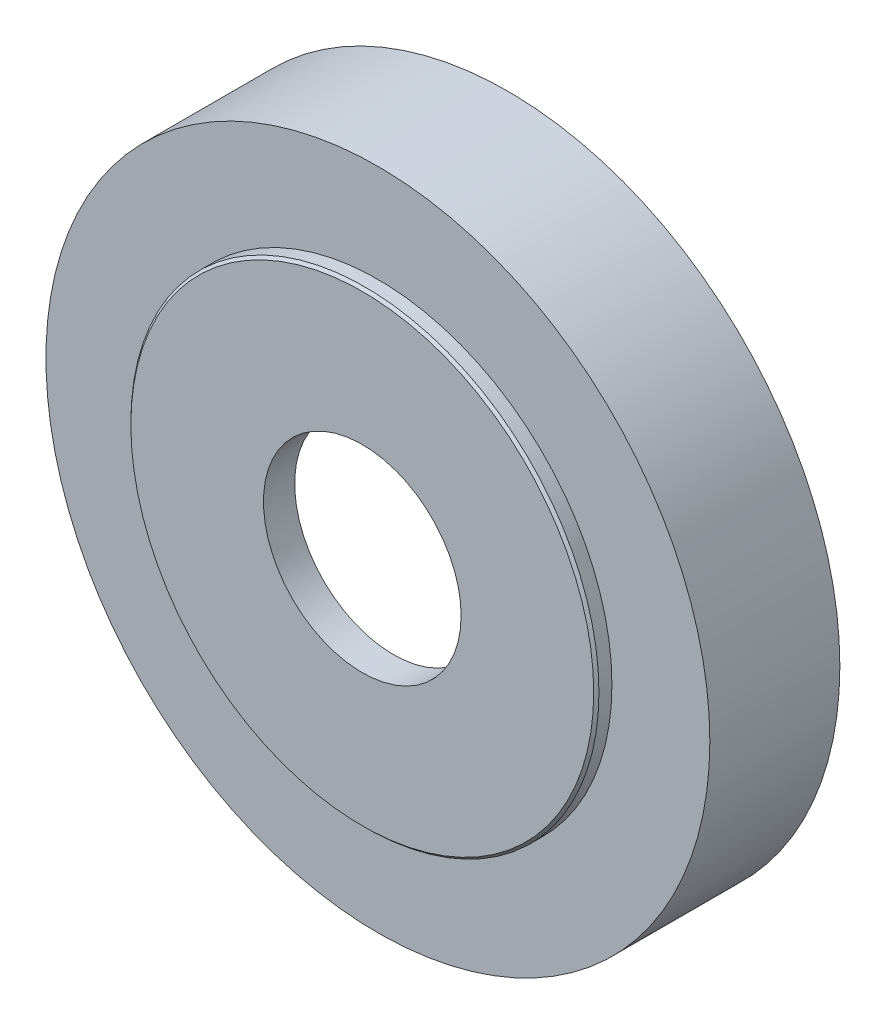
ISO-10303-21;
HEADER;
FILE_DESCRIPTION(('STEP AP214'),'2;1');
FILE_NAME('part.step','',(''),(''),'','','');
FILE_SCHEMA(('AUTOMOTIVE_DESIGN { 1 0 10303 214 1 1 1 1 }'));
ENDSEC;
DATA;
#1=APPLICATION_CONTEXT('core data for automotive mechanical design processes');
#2=APPLICATION_PROTOCOL_DEFINITION('international standard','automotive_design',2000,#1);
#3=PRODUCT_CONTEXT('',#1,'mechanical');
#4=PRODUCT('Part','Part','',(#3));
#5=PRODUCT_RELATED_PRODUCT_CATEGORY('part','',(#4));
#6=PRODUCT_DEFINITION_FORMATION('','',#4);
#7=PRODUCT_DEFINITION_CONTEXT('part definition',#1,'design');
#8=PRODUCT_DEFINITION('design','',#6,#7);
#9=PRODUCT_DEFINITION_SHAPE('','',#8);
#10=(LENGTH_UNIT() NAMED_UNIT(*) SI_UNIT(.MILLI.,.METRE.));
#11=(NAMED_UNIT(*) PLANE_ANGLE_UNIT() SI_UNIT($,.RADIAN.));
#12=(NAMED_UNIT(*) SI_UNIT($,.STERADIAN.) SOLID_ANGLE_UNIT());
#13=UNCERTAINTY_MEASURE_WITH_UNIT(LENGTH_MEASURE(1.E-05),#10,'distance_accuracy_value','');
#14=(GEOMETRIC_REPRESENTATION_CONTEXT(3) GLOBAL_UNCERTAINTY_ASSIGNED_CONTEXT((#13)) GLOBAL_UNIT_ASSIGNED_CONTEXT((#10,
#11,#12)) REPRESENTATION_CONTEXT('',''));
#15=CARTESIAN_POINT('',(0.,0.,0.));
#16=DIRECTION('',(0.,0.,1.));
#17=DIRECTION('',(1.,0.,0.));
#18=AXIS2_PLACEMENT_3D('',#15,#16,#17);
#19=CARTESIAN_POINT('',(0.,0.,-28.));
#20=DIRECTION('',(0.,0.,1.));
#21=DIRECTION('',(1.,0.,0.));
#22=AXIS2_PLACEMENT_3D('',#19,#20,#21);
#23=CYLINDRICAL_SURFACE('',#22,63.825);
#24=CARTESIAN_POINT('',(0.,0.,-3.));
#25=DIRECTION('',(0.,0.,1.));
#26=DIRECTION('',(1.,0.,0.));
#27=AXIS2_PLACEMENT_3D('',#24,#25,#26);
#28=CIRCLE('',#27,63.825);
#29=CARTESIAN_POINT('',(63.825,0.,-3.));
#30=VERTEX_POINT('',#29);
#31=EDGE_CURVE('E136',#30,#30,#28,.T.);
#32=ORIENTED_EDGE('',*,*,#31,.F.);
#33=EDGE_LOOP('',(#32));
#34=FACE_BOUND('',#33,.T.);
#35=CARTESIAN_POINT('',(0.,0.,-28.));
#36=DIRECTION('',(0.,0.,1.));
#37=DIRECTION('',(1.,0.,0.));
#38=AXIS2_PLACEMENT_3D('',#35,#36,#37);
#39=CIRCLE('',#38,63.825);
#40=CARTESIAN_POINT('',(63.825,0.,-28.));
#41=VERTEX_POINT('',#40);
#42=EDGE_CURVE('E139',#41,#41,#39,.T.);
#43=ORIENTED_EDGE('',*,*,#42,.T.);
#44=EDGE_LOOP('',(#43));
#45=FACE_BOUND('',#44,.T.);
#46=CARTESIAN_POINT('',(21.8294356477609,-59.975881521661,-8.49999999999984));
#47=CARTESIAN_POINT('',(21.6321597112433,-60.0476848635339,-8.4999977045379));
#48=CARTESIAN_POINT('',(21.434560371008,-60.1184998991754,-8.50881790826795));
#49=CARTESIAN_POINT('',(21.0400080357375,-60.2577167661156,-8.54403172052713));
#50=CARTESIAN_POINT('',(20.8430552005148,-60.3261180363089,-8.57042938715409));
#51=CARTESIAN_POINT('',(20.4511402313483,-60.4601060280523,-8.64063591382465));
#52=CARTESIAN_POINT('',(20.2561797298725,-60.525690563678,-8.68445803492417));
#53=CARTESIAN_POINT('',(19.8697482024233,-60.6536492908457,-8.78920833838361));
#54=CARTESIAN_POINT('',(19.6782784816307,-60.7160222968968,-8.85014278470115));
#55=CARTESIAN_POINT('',(19.3005017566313,-60.8371643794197,-8.98859401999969));
#56=CARTESIAN_POINT('',(19.1141896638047,-60.8959370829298,-9.06609375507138));
#57=CARTESIAN_POINT('',(18.7478243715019,-61.0097247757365,-9.23718363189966));
#58=CARTESIAN_POINT('',(18.5677735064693,-61.064738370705,-9.33077969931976));
#59=CARTESIAN_POINT('',(18.2154288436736,-61.1707659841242,-9.53331627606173));
#60=CARTESIAN_POINT('',(18.0431307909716,-61.2217822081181,-9.64224822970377));
#61=CARTESIAN_POINT('',(17.7073970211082,-61.319730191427,-9.87476834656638));
#62=CARTESIAN_POINT('',(17.543964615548,-61.3666604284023,-9.99836193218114));
#63=CARTESIAN_POINT('',(17.2266135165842,-61.4565026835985,-10.2598283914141));
#64=CARTESIAN_POINT('',(17.0727354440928,-61.4993978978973,-10.3977563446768));
#65=CARTESIAN_POINT('',(16.7763151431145,-61.5809184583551,-10.6865655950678));
#66=CARTESIAN_POINT('',(16.6337771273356,-61.619542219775,-10.8374516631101));
#67=CARTESIAN_POINT('',(16.3612309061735,-61.6924683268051,-11.151028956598));
#68=CARTESIAN_POINT('',(16.2312187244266,-61.7267720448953,-11.3137164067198));
#69=CARTESIAN_POINT('',(15.9846299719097,-61.7910873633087,-11.6498665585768));
#70=CARTESIAN_POINT('',(15.8680583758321,-61.8210973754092,-11.8233332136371));
#71=CARTESIAN_POINT('',(15.6490134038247,-61.8769086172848,-12.1802721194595));
#72=CARTESIAN_POINT('',(15.546580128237,-61.9026979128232,-12.3637708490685));
#73=CARTESIAN_POINT('',(15.3570123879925,-61.9499987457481,-12.7390393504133));
#74=CARTESIAN_POINT('',(15.2698781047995,-61.9715102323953,-12.9308092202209));
#75=CARTESIAN_POINT('',(15.1116182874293,-62.010291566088,-13.3212504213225));
#76=CARTESIAN_POINT('',(15.0404920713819,-62.0275615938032,-13.519921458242));
#77=CARTESIAN_POINT('',(14.9148259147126,-62.0578985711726,-13.9227592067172));
#78=CARTESIAN_POINT('',(14.8602862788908,-62.0709654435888,-14.1269260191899));
#79=CARTESIAN_POINT('',(14.768470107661,-62.0928750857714,-14.5382936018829));
#80=CARTESIAN_POINT('',(14.7311117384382,-62.1017378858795,-14.7454750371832));
#81=CARTESIAN_POINT('',(14.6735711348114,-62.1153588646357,-15.1624129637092));
#82=CARTESIAN_POINT('',(14.6533948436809,-62.1201156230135,-15.3721703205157));
#83=CARTESIAN_POINT('',(14.6304197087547,-62.125531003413,-15.7926196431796));
#84=CARTESIAN_POINT('',(14.627614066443,-62.1261912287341,-16.0033112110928));
#85=CARTESIAN_POINT('',(14.6393648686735,-62.1234222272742,-16.4242036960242));
#86=CARTESIAN_POINT('',(14.6539277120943,-62.1199914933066,-16.6344044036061));
#87=CARTESIAN_POINT('',(14.7233368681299,-62.103596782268,-17.259725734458));
#88=CARTESIAN_POINT('',(14.8037652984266,-62.0845634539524,-17.6721670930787));
#89=CARTESIAN_POINT('',(15.0304762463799,-62.0300631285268,-18.4771503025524));
#90=CARTESIAN_POINT('',(15.1767599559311,-61.9945958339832,-18.8696917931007));
#91=CARTESIAN_POINT('',(15.5309262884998,-61.9068186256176,-19.6251322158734));
#92=CARTESIAN_POINT('',(15.7389590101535,-61.8544676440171,-19.9879561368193));
#93=CARTESIAN_POINT('',(16.2099768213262,-61.7326999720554,-20.6727605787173));
#94=CARTESIAN_POINT('',(16.4729641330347,-61.663282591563,-20.9947394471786));
#95=CARTESIAN_POINT('',(17.0476273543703,-61.5068941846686,-21.5907934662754));
#96=CARTESIAN_POINT('',(17.3595905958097,-61.4198186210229,-21.8645642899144));
#97=CARTESIAN_POINT('',(18.0215927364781,-61.2288436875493,-22.3540589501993));
#98=CARTESIAN_POINT('',(18.371631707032,-61.1249442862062,-22.5697826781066));
#99=CARTESIAN_POINT('',(19.0994295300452,-60.9014547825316,-22.9370572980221));
#100=CARTESIAN_POINT('',(19.4771960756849,-60.7818603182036,-23.0885903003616));
#101=CARTESIAN_POINT('',(20.2491324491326,-60.5290679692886,-23.3229458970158));
#102=CARTESIAN_POINT('',(20.6433015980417,-60.3958706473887,-23.4057713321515));
#103=CARTESIAN_POINT('',(21.4340885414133,-60.1197538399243,-23.4999693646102));
#104=CARTESIAN_POINT('',(21.8306780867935,-59.976896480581,-23.5117614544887));
#105=CARTESIAN_POINT('',(22.6172236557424,-59.6847370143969,-23.4646621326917));
#106=CARTESIAN_POINT('',(23.0071798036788,-59.5354350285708,-23.4057720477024));
#107=CARTESIAN_POINT('',(23.76844077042,-59.2356212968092,-23.2193330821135));
#108=CARTESIAN_POINT('',(24.1397962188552,-59.0851142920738,-23.0919830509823));
#109=CARTESIAN_POINT('',(24.855085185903,-58.7878007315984,-22.7724277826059));
#110=CARTESIAN_POINT('',(25.1990178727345,-58.6409942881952,-22.580220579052));
#111=CARTESIAN_POINT('',(25.8519640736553,-58.3560986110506,-22.135448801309));
#112=CARTESIAN_POINT('',(26.160810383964,-58.2180523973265,-21.882611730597));
#113=CARTESIAN_POINT('',(26.7340298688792,-57.9570670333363,-21.3239014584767));
#114=CARTESIAN_POINT('',(26.9984014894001,-57.8341284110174,-21.0180264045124));
#115=CARTESIAN_POINT('',(27.3569458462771,-57.6649442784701,-20.5254830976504));
#116=CARTESIAN_POINT('',(27.4704096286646,-57.610947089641,-20.3551142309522));
#117=CARTESIAN_POINT('',(27.6836976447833,-57.5087599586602,-20.004414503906));
#118=CARTESIAN_POINT('',(27.7835269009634,-57.4605678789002,-19.8240873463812));
#119=CARTESIAN_POINT('',(27.9689426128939,-57.3705456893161,-19.4546654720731));
#120=CARTESIAN_POINT('',(28.054524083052,-57.3287178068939,-19.2655677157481));
#121=CARTESIAN_POINT('',(28.2108407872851,-57.2519577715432,-18.880056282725));
#122=CARTESIAN_POINT('',(28.2815812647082,-57.2170231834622,-18.6836452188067));
#123=CARTESIAN_POINT('',(28.4076585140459,-57.1545318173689,-18.2852776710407));
#124=CARTESIAN_POINT('',(28.4630283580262,-57.1269592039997,-18.0833341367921));
#125=CARTESIAN_POINT('',(28.5582101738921,-57.079436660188,-17.6749379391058));
#126=CARTESIAN_POINT('',(28.5980225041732,-57.0594865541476,-17.4684853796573));
#127=CARTESIAN_POINT('',(28.6618317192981,-57.0274609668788,-17.0525505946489));
#128=CARTESIAN_POINT('',(28.6858288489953,-57.0153853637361,-16.8430684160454));
#129=CARTESIAN_POINT('',(28.7178517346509,-56.9992626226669,-16.4225834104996));
#130=CARTESIAN_POINT('',(28.7258778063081,-56.9952153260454,-16.211580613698));
#131=CARTESIAN_POINT('',(28.7259070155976,-56.9952005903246,-15.7908290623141));
#132=CARTESIAN_POINT('',(28.7180051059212,-56.9991852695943,-15.5810803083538));
#133=CARTESIAN_POINT('',(28.6864251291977,-57.0150852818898,-15.1631501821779));
#134=CARTESIAN_POINT('',(28.6627525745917,-57.0269978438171,-14.9549682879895));
#135=CARTESIAN_POINT('',(28.5997836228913,-57.0586035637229,-14.5415408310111));
#136=CARTESIAN_POINT('',(28.5604843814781,-57.0782981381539,-14.3362958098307));
#137=CARTESIAN_POINT('',(28.4665152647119,-57.1252211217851,-13.9302387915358));
#138=CARTESIAN_POINT('',(28.4118457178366,-57.1524493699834,-13.7294266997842));
#139=CARTESIAN_POINT('',(28.2875007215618,-57.2140956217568,-13.3336980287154));
#140=CARTESIAN_POINT('',(28.2178292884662,-57.2485117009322,-13.1387798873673));
#141=CARTESIAN_POINT('',(28.0639133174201,-57.3241200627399,-12.756148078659));
#142=CARTESIAN_POINT('',(27.9796689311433,-57.3653122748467,-12.568434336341));
#143=CARTESIAN_POINT('',(27.7971184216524,-57.453991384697,-12.2014794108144));
#144=CARTESIAN_POINT('',(27.6988096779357,-57.5014794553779,-12.0222398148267));
#145=CARTESIAN_POINT('',(27.4887945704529,-57.6021731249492,-11.6735737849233));
#146=CARTESIAN_POINT('',(27.3770930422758,-57.655376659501,-11.504143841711));
#147=CARTESIAN_POINT('',(27.1402190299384,-57.767260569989,-11.1751670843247));
#148=CARTESIAN_POINT('',(27.0149665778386,-57.8259731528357,-11.0156887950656));
#149=CARTESIAN_POINT('',(26.752408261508,-57.9479094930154,-10.708949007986));
#150=CARTESIAN_POINT('',(26.6151067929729,-58.0111316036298,-10.5616830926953));
#151=CARTESIAN_POINT('',(26.3291928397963,-58.1414561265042,-10.280247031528));
#152=CARTESIAN_POINT('',(26.1805735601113,-58.2085608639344,-10.146084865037));
#153=CARTESIAN_POINT('',(25.8731027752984,-58.3458782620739,-9.89194879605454));
#154=CARTESIAN_POINT('',(25.7142550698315,-58.4160897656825,-9.77196967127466));
#155=CARTESIAN_POINT('',(25.3866872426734,-58.5591905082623,-9.54656933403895));
#156=CARTESIAN_POINT('',(25.2179322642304,-58.6320888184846,-9.44120452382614));
#157=CARTESIAN_POINT('',(24.8722732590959,-58.7795537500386,-9.24636503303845));
#158=CARTESIAN_POINT('',(24.6953722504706,-58.8541197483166,-9.15688452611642));
#159=CARTESIAN_POINT('',(24.3346865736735,-59.0041673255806,-8.99448207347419));
#160=CARTESIAN_POINT('',(24.1509074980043,-59.0796481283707,-8.92154700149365));
#161=CARTESIAN_POINT('',(23.777650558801,-59.2308578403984,-8.79269899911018));
#162=CARTESIAN_POINT('',(23.5881740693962,-59.3065866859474,-8.73678199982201));
#163=CARTESIAN_POINT('',(23.1410322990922,-59.4827579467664,-8.62667087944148));
#164=CARTESIAN_POINT('',(22.8816205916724,-59.5830548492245,-8.57921713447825));
#165=CARTESIAN_POINT('',(22.3581451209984,-59.7814545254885,-8.51588333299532));
#166=CARTESIAN_POINT('',(22.0940813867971,-59.8795573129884,-8.50000307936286));
#167=CARTESIAN_POINT('',(21.8294356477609,-59.975881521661,-8.49999999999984));
#168=B_SPLINE_CURVE_WITH_KNOTS('',3,(#46,#47,#48,#49,#50,#51,#52,#53,#54,#55,#56,#57,#58,#59,
#60,#61,#62,#63,#64,#65,#66,#67,#68,#69,#70,#71,#72,#73,#74,#75,#76,#77,#78,#79,#80,#81,#82,#83,
#84,#85,#86,#87,#88,#89,#90,#91,#92,#93,#94,#95,#96,#97,#98,#99,#100,#101,#102,#103,#104,#105,
#106,#107,#108,#109,#110,#111,#112,#113,#114,#115,#116,#117,#118,#119,#120,#121,#122,#123,#124,
#125,#126,#127,#128,#129,#130,#131,#132,#133,#134,#135,#136,#137,#138,#139,#140,#141,#142,#143,
#144,#145,#146,#147,#148,#149,#150,#151,#152,#153,#154,#155,#156,#157,#158,#159,#160,#161,#162,
#163,#164,#165,#166,#167),.UNSPECIFIED.,.T.,.F.,(4,2,2,2,2,2,2,2,2,2,2,2,2,2,2,2,2,2,2,2,2,2,2,
2,2,2,2,2,2,2,2,2,2,2,2,2,2,2,2,2,2,2,2,2,2,2,2,2,2,2,2,2,2,2,2,2,2,2,2,2,4),(0.,
0.62956439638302,1.25927419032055,1.88946415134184,2.51988509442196,3.14966012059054,
3.77966748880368,4.40932476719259,5.03921564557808,5.6716232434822,6.3042646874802,
6.93670463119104,7.5693779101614,8.20381029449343,8.83825020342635,9.47266308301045,
10.107087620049,10.7384582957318,11.3700472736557,12.0013890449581,12.6329634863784,
13.8883953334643,15.1438499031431,16.4023815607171,17.6609641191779,18.9272272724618,
20.1934927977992,21.4601109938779,22.7266768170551,23.9857554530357,25.2448104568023,
26.500228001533,27.7556836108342,29.0168911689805,30.2781427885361,30.9126118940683,
31.5468466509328,32.1813028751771,32.8155345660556,33.4483908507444,34.0812325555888,
34.7140644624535,35.3468838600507,35.9759419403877,36.6047802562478,37.2337330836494,
37.8626724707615,38.4914436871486,39.1202083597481,39.7490903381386,40.3777459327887,
41.0103378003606,41.6426998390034,42.2754445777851,42.9079556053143,43.5428435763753,
44.1774981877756,44.8116475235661,45.4456451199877,46.2902112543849,47.1347721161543),.UNSPECIFIED.);
#169=CARTESIAN_POINT('',(21.8294356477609,-59.975881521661,-8.49999999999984));
#170=VERTEX_POINT('',#169);
#171=EDGE_CURVE('E42',#170,#170,#168,.T.);
#172=ORIENTED_EDGE('',*,*,#171,.F.);
#173=EDGE_LOOP('',(#172));
#174=FACE_BOUND('',#173,.T.);
#175=CARTESIAN_POINT('',(-21.8294356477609,-59.975881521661,-8.49999999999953));
#176=CARTESIAN_POINT('',(-22.0267120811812,-59.9040795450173,-8.49999770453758));
#177=CARTESIAN_POINT('',(-22.2236009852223,-59.8313126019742,-8.50881790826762));
#178=CARTESIAN_POINT('',(-22.6153324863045,-59.6843455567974,-8.5440317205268));
#179=CARTESIAN_POINT('',(-22.8101746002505,-59.6101451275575,-8.57042938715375));
#180=CARTESIAN_POINT('',(-23.1965247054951,-59.4608677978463,-8.6406359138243));
#181=CARTESIAN_POINT('',(-23.3880300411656,-59.38579027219,-8.68445803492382));
#182=CARTESIAN_POINT('',(-23.7663040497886,-59.2354189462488,-8.78920833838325));
#183=CARTESIAN_POINT('',(-23.9530709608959,-59.1601250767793,-8.85014278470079));
#184=CARTESIAN_POINT('',(-24.3203333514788,-59.0100950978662,-8.98859401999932));
#185=CARTESIAN_POINT('',(-24.5008350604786,-58.9353584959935,-9.06609375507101));
#186=CARTESIAN_POINT('',(-24.8546284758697,-58.7870298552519,-9.23718363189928));
#187=CARTESIAN_POINT('',(-25.0279174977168,-58.7134382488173,-9.33077969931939));
#188=CARTESIAN_POINT('',(-25.3659824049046,-58.5681773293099,-9.53331627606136));
#189=CARTESIAN_POINT('',(-25.5307629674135,-58.4965069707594,-9.6422482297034));
#190=CARTESIAN_POINT('',(-25.8509097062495,-58.3557339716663,-9.874768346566));
#191=CARTESIAN_POINT('',(-26.0062723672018,-58.2866322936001,-9.99836193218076));
#192=CARTESIAN_POINT('',(-26.3071269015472,-58.1514660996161,-10.2598283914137));
#193=CARTESIAN_POINT('',(-26.4525768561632,-58.0854148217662,-10.3977563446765));
#194=CARTESIAN_POINT('',(-26.7320483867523,-57.9573278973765,-10.6865655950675));
#195=CARTESIAN_POINT('',(-26.8660657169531,-57.8952937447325,-10.8374516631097));
#196=CARTESIAN_POINT('',(-27.1217242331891,-57.7759690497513,-11.1510289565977));
#197=CARTESIAN_POINT('',(-27.2433693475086,-57.7186770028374,-11.3137164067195));
#198=CARTESIAN_POINT('',(-27.4736083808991,-57.6094412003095,-11.6498665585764));
#199=CARTESIAN_POINT('',(-27.5821974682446,-57.5574994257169,-11.8233332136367));
#200=CARTESIAN_POINT('',(-27.7858704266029,-57.4594539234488,-12.1802721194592));
#201=CARTESIAN_POINT('',(-27.8809159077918,-57.4133668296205,-12.3637708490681));
#202=CARTESIAN_POINT('',(-28.0565376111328,-57.3277495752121,-12.7390393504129));
#203=CARTESIAN_POINT('',(-28.1371136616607,-57.2882194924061,-12.9308092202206));
#204=CARTESIAN_POINT('',(-28.283275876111,-57.2162002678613,-13.3212504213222));
#205=CARTESIAN_POINT('',(-28.3488626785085,-57.1837108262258,-13.5199214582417));
#206=CARTESIAN_POINT('',(-28.4646287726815,-57.1261736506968,-13.9227592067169));
#207=CARTESIAN_POINT('',(-28.514807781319,-57.101126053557,-14.1269260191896));
#208=CARTESIAN_POINT('',(-28.5992262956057,-57.0588915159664,-14.5382936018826));
#209=CARTESIAN_POINT('',(-28.6335413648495,-57.0416673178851,-14.745475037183));
#210=CARTESIAN_POINT('',(-28.6863754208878,-57.015115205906,-15.1624129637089));
#211=CARTESIAN_POINT('',(-28.7048889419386,-57.0057900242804,-15.3721703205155));
#212=CARTESIAN_POINT('',(-28.7259698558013,-56.9951703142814,-15.7926196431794));
#213=CARTESIAN_POINT('',(-28.7285434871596,-56.9938726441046,-16.0033112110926));
#214=CARTESIAN_POINT('',(-28.7177619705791,-56.999304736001,-16.424203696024));
#215=CARTESIAN_POINT('',(-28.704400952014,-57.006037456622,-16.634404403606));
#216=CARTESIAN_POINT('',(-28.6406921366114,-57.0380937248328,-17.2597257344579));
#217=CARTESIAN_POINT('',(-28.5668459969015,-57.0752117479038,-17.6721670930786));
#218=CARTESIAN_POINT('',(-28.3581432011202,-57.179189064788,-18.4771503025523));
#219=CARTESIAN_POINT('',(-28.2232854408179,-57.2460488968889,-18.8696917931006));
#220=CARTESIAN_POINT('',(-27.8955561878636,-57.4064613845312,-19.6251322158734));
#221=CARTESIAN_POINT('',(-27.7025433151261,-57.5000790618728,-19.9879561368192));
#222=CARTESIAN_POINT('',(-27.2634519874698,-57.7095640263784,-20.6727605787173));
#223=CARTESIAN_POINT('',(-27.0173713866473,-57.8254322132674,-20.9947394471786));
#224=CARTESIAN_POINT('',(-26.476629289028,-58.0750181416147,-21.5907934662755));
#225=CARTESIAN_POINT('',(-26.181680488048,-58.2088404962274,-21.8645642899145));
#226=CARTESIAN_POINT('',(-25.5518011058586,-58.4880719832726,-22.3540589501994));
#227=CARTESIAN_POINT('',(-25.2168704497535,-58.6334811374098,-22.5697826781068));
#228=CARTESIAN_POINT('',(-24.5156886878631,-58.9300976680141,-22.9370572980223));
#229=CARTESIAN_POINT('',(-24.1494288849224,-59.0813066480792,-23.0885903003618));
#230=CARTESIAN_POINT('',(-23.3955995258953,-59.3838476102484,-23.3229458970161));
#231=CARTESIAN_POINT('',(-23.0080308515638,-59.5351795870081,-23.4057713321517));
#232=CARTESIAN_POINT('',(-22.2247684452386,-59.8319698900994,-23.4999693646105));
#233=CARTESIAN_POINT('',(-21.8291362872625,-59.9774576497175,-23.511761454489));
#234=CARTESIAN_POINT('',(-21.0388109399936,-60.2592322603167,-23.464662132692));
#235=CARTESIAN_POINT('',(-20.6441177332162,-60.3955192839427,-23.4057720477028));
#236=CARTESIAN_POINT('',(-19.8682414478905,-60.6551777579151,-23.2193330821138));
#237=CARTESIAN_POINT('',(-19.4870226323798,-60.7785853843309,-23.0919830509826));
#238=CARTESIAN_POINT('',(-18.747970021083,-61.0106088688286,-22.7724277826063));
#239=CARTESIAN_POINT('',(-18.390136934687,-61.119224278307,-22.5802205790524));
#240=CARTESIAN_POINT('',(-17.7068237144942,-61.3206872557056,-22.1354488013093));
#241=CARTESIAN_POINT('',(-17.3814993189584,-61.4134603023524,-21.8826117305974));
#242=CARTESIAN_POINT('',(-16.7746295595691,-61.5819922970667,-21.323901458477));
#243=CARTESIAN_POINT('',(-16.4930857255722,-61.6577506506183,-21.0180264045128));
#244=CARTESIAN_POINT('',(-16.1096753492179,-61.7586159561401,-20.5254830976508));
#245=CARTESIAN_POINT('',(-15.9880483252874,-61.7901848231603,-20.3551142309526));
#246=CARTESIAN_POINT('',(-15.758975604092,-61.84900383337,-20.0044145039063));
#247=CARTESIAN_POINT('',(-15.6515246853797,-61.8762555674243,-19.8240873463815));
#248=CARTESIAN_POINT('',(-15.4516228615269,-61.9264774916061,-19.4546654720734));
#249=CARTESIAN_POINT('',(-15.3591772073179,-61.9494461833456,-19.2655677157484));
#250=CARTESIAN_POINT('',(-15.1900912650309,-61.9911230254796,-18.8800562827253));
#251=CARTESIAN_POINT('',(-15.1134453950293,-62.0098326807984,-18.683645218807));
#252=CARTESIAN_POINT('',(-14.9766959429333,-62.0430024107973,-18.285277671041));
#253=CARTESIAN_POINT('',(-14.9165568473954,-62.0574716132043,-18.0833341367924));
#254=CARTESIAN_POINT('',(-14.8130964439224,-62.0822489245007,-17.6749379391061));
#255=CARTESIAN_POINT('',(-14.7697747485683,-62.0925571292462,-17.4684853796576));
#256=CARTESIAN_POINT('',(-14.7003084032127,-62.1090398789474,-17.0525505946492));
#257=CARTESIAN_POINT('',(-14.6741634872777,-62.1152144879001,-16.8430684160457));
#258=CARTESIAN_POINT('',(-14.6392690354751,-62.123447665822,-16.4225834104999));
#259=CARTESIAN_POINT('',(-14.630519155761,-62.1255063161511,-16.2115806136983));
#260=CARTESIAN_POINT('',(-14.6304873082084,-62.1255138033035,-15.7908290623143));
#261=CARTESIAN_POINT('',(-14.6391018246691,-62.1234869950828,-15.581080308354));
#262=CARTESIAN_POINT('',(-14.6735138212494,-62.1153678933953,-15.1631501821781));
#263=CARTESIAN_POINT('',(-14.6993052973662,-62.1092770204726,-14.9549682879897));
#264=CARTESIAN_POINT('',(-14.767858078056,-62.0930127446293,-14.5415408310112));
#265=CARTESIAN_POINT('',(-14.8106224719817,-62.0828385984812,-14.3362958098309));
#266=CARTESIAN_POINT('',(-14.9127685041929,-62.0583815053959,-13.9302387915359));
#267=CARTESIAN_POINT('',(-14.9721497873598,-62.0440986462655,-13.7294266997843));
#268=CARTESIAN_POINT('',(-15.1070290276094,-62.0113949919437,-13.3336980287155));
#269=CARTESIAN_POINT('',(-15.1825226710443,-61.992975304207,-13.1387798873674));
#270=CARTESIAN_POINT('',(-15.3490292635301,-61.9519593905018,-12.7561480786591));
#271=CARTESIAN_POINT('',(-15.4400420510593,-61.9293632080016,-12.5684343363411));
#272=CARTESIAN_POINT('',(-15.6368856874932,-61.8799541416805,-12.2014794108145));
#273=CARTESIAN_POINT('',(-15.7427192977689,-61.8531404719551,-12.0222398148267));
#274=CARTESIAN_POINT('',(-15.9683248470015,-61.7952811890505,-11.6735737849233));
#275=CARTESIAN_POINT('',(-16.0880917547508,-61.7642371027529,-11.5041438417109));
#276=CARTESIAN_POINT('',(-16.3414653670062,-61.6976854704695,-11.1751670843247));
#277=CARTESIAN_POINT('',(-16.4751540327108,-61.6621511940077,-11.0156887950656));
#278=CARTESIAN_POINT('',(-16.7546645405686,-61.5867906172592,-10.7089490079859));
#279=CARTESIAN_POINT('',(-16.9004819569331,-61.5469658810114,-10.5616830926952));
#280=CARTESIAN_POINT('',(-17.2032757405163,-61.4630183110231,-10.2802470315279));
#281=CARTESIAN_POINT('',(-17.3602588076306,-61.4188928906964,-10.1460848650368));
#282=CARTESIAN_POINT('',(-17.6840610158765,-61.3264457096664,-9.8919487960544));
#283=CARTESIAN_POINT('',(-17.8508765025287,-61.2781255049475,-9.77196967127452));
#284=CARTESIAN_POINT('',(-18.193791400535,-61.1771904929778,-9.54656933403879));
#285=CARTESIAN_POINT('',(-18.3699233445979,-61.1245602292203,-9.44120452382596));
#286=CARTESIAN_POINT('',(-18.7295021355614,-61.0153395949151,-9.24636503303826));
#287=CARTESIAN_POINT('',(-18.912946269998,-60.9587506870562,-9.15688452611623));
#288=CARTESIAN_POINT('',(-19.2856962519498,-60.8418495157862,-8.99448207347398));
#289=CARTESIAN_POINT('',(-19.4749973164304,-60.7815402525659,-8.92154700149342));
#290=CARTESIAN_POINT('',(-19.8581244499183,-60.6574486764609,-8.79269899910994));
#291=CARTESIAN_POINT('',(-20.0519494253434,-60.5936671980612,-8.73678199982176));
#292=CARTESIAN_POINT('',(-20.5077205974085,-60.4412050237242,-8.62667087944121));
#293=CARTESIAN_POINT('',(-20.7709111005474,-60.3512902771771,-8.57921713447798));
#294=CARTESIAN_POINT('',(-21.2994454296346,-60.1667897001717,-8.51588333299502));
#295=CARTESIAN_POINT('',(-21.5647892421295,-60.0722038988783,-8.50000307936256));
#296=CARTESIAN_POINT('',(-21.8294356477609,-59.975881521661,-8.49999999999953));
#297=B_SPLINE_CURVE_WITH_KNOTS('',3,(#175,#176,#177,#178,#179,#180,#181,#182,#183,#184,#185,
#186,#187,#188,#189,#190,#191,#192,#193,#194,#195,#196,#197,#198,#199,#200,#201,#202,#203,#204,
#205,#206,#207,#208,#209,#210,#211,#212,#213,#214,#215,#216,#217,#218,#219,#220,#221,#222,#223,
#224,#225,#226,#227,#228,#229,#230,#231,#232,#233,#234,#235,#236,#237,#238,#239,#240,#241,#242,
#243,#244,#245,#246,#247,#248,#249,#250,#251,#252,#253,#254,#255,#256,#257,#258,#259,#260,#261,
#262,#263,#264,#265,#266,#267,#268,#269,#270,#271,#272,#273,#274,#275,#276,#277,#278,#279,#280,
#281,#282,#283,#284,#285,#286,#287,#288,#289,#290,#291,#292,#293,#294,#295,#296),.UNSPECIFIED.,
.T.,.F.,(4,2,2,2,2,2,2,2,2,2,2,2,2,2,2,2,2,2,2,2,2,2,2,2,2,2,2,2,2,2,2,2,2,2,2,2,2,2,2,2,2,2,2,
2,2,2,2,2,2,2,2,2,2,2,2,2,2,2,2,2,4),(0.,0.629564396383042,1.2592741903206,1.88946415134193,
2.51988509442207,3.14966012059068,3.77966748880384,4.40932476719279,5.03921564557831,
5.67162324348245,6.30426468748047,6.93670463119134,7.56937791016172,8.20381029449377,
8.83825020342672,9.47266308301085,10.1070876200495,10.7384582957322,11.3700472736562,
12.0013890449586,12.6329634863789,13.8883953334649,15.1438499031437,16.4023815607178,
17.6609641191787,18.9272272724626,20.1934927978,21.4601109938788,22.7266768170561,
23.9857554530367,25.2448104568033,26.5002280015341,27.7556836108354,29.0168911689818,
30.2781427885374,30.9126118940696,31.5468466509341,32.1813028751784,32.815534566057,
33.4483908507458,34.0812325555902,34.7140644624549,35.3468838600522,35.9759419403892,
36.6047802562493,37.233733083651,37.8626724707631,38.4914436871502,39.1202083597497,
39.7490903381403,40.3777459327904,41.0103378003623,41.6426998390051,42.2754445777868,
42.9079556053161,43.5428435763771,44.1774981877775,44.811647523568,45.4456451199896,
46.2902112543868,47.1347721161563),.UNSPECIFIED.);
#298=CARTESIAN_POINT('',(-21.8294356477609,-59.975881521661,-8.49999999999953));
#299=VERTEX_POINT('',#298);
#300=EDGE_CURVE('E10',#299,#299,#297,.T.);
#301=ORIENTED_EDGE('',*,*,#300,.F.);
#302=EDGE_LOOP('',(#301));
#303=FACE_BOUND('',#302,.T.);
#304=ADVANCED_FACE('F31',(#34,#45,#174,#303),#23,.T.);
#305=CARTESIAN_POINT('',(0.,0.,-28.));
#306=DIRECTION('',(0.,0.,1.));
#307=DIRECTION('',(1.,0.,0.));
#308=AXIS2_PLACEMENT_3D('',#305,#306,#307);
#309=CYLINDRICAL_SURFACE('',#308,49.);
#310=CARTESIAN_POINT('',(12.6701398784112,-47.3335774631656,-16.));
#311=CARTESIAN_POINT('',(12.6701505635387,-47.3335762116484,-15.759915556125));
#312=CARTESIAN_POINT('',(12.689785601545,-47.328332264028,-15.519668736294));
#313=CARTESIAN_POINT('',(12.7677722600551,-47.3073520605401,-15.045825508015));
#314=CARTESIAN_POINT('',(12.8261674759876,-47.2916039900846,-14.8122368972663));
#315=CARTESIAN_POINT('',(12.9798197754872,-47.2496622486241,-14.3586413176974));
#316=CARTESIAN_POINT('',(13.0750556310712,-47.2234745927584,-14.1386266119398));
#317=CARTESIAN_POINT('',(13.299418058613,-47.1607780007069,-13.7182960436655));
#318=CARTESIAN_POINT('',(13.4285375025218,-47.124271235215,-13.5179760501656));
#319=CARTESIAN_POINT('',(13.7171096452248,-47.0410824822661,-13.1421069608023));
#320=CARTESIAN_POINT('',(13.8766371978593,-46.9943753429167,-12.9666208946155));
#321=CARTESIAN_POINT('',(14.2210259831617,-46.8913068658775,-12.6459428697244));
#322=CARTESIAN_POINT('',(14.4058883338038,-46.834945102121,-12.5007522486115));
#323=CARTESIAN_POINT('',(14.7957655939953,-46.7132425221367,-12.2445746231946));
#324=CARTESIAN_POINT('',(15.0008121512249,-46.6478875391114,-12.1336424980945));
#325=CARTESIAN_POINT('',(15.4247523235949,-46.5094257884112,-11.9494818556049));
#326=CARTESIAN_POINT('',(15.6436456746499,-46.4363191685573,-11.8762526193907));
#327=CARTESIAN_POINT('',(16.0882912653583,-46.2841433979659,-11.7697588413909));
#328=CARTESIAN_POINT('',(16.3140243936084,-46.2050900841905,-11.736391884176));
#329=CARTESIAN_POINT('',(16.7663622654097,-46.0428801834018,-11.7102531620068));
#330=CARTESIAN_POINT('',(16.9929669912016,-45.9597236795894,-11.7174805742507));
#331=CARTESIAN_POINT('',(17.4399836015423,-45.7919624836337,-11.7722418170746));
#332=CARTESIAN_POINT('',(17.6604107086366,-45.7073623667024,-11.8196655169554));
#333=CARTESIAN_POINT('',(18.0895963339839,-45.5392101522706,-11.9533018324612));
#334=CARTESIAN_POINT('',(18.2983547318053,-45.4556580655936,-12.0395148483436));
#335=CARTESIAN_POINT('',(18.6988046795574,-45.292400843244,-12.2484048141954));
#336=CARTESIAN_POINT('',(18.8904727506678,-45.2127010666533,-12.3711309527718));
#337=CARTESIAN_POINT('',(19.2513243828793,-45.0602368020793,-12.6495277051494));
#338=CARTESIAN_POINT('',(19.4205074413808,-44.9874724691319,-12.8051990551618));
#339=CARTESIAN_POINT('',(19.732479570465,-44.8515146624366,-13.1456876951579));
#340=CARTESIAN_POINT('',(19.875178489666,-44.7883540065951,-13.3306007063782));
#341=CARTESIAN_POINT('',(20.129751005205,-44.6745188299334,-13.7239904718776));
#342=CARTESIAN_POINT('',(20.2416245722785,-44.6238443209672,-13.9324672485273));
#343=CARTESIAN_POINT('',(20.4316388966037,-44.5371653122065,-14.3671354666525));
#344=CARTESIAN_POINT('',(20.5097748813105,-44.5011628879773,-14.5933294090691));
#345=CARTESIAN_POINT('',(20.6302366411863,-44.4454472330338,-15.0569780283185));
#346=CARTESIAN_POINT('',(20.67256324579,-44.4257336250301,-15.2944324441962));
#347=CARTESIAN_POINT('',(20.7202116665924,-44.4035306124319,-15.7730214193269));
#348=CARTESIAN_POINT('',(20.7256553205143,-44.4009844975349,-16.0141412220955));
#349=CARTESIAN_POINT('',(20.6997179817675,-44.4130822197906,-16.4939544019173));
#350=CARTESIAN_POINT('',(20.6683373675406,-44.4277258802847,-16.7326478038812));
#351=CARTESIAN_POINT('',(20.5696563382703,-44.4734995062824,-17.2004468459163));
#352=CARTESIAN_POINT('',(20.5024130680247,-44.5046032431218,-17.4295671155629));
#353=CARTESIAN_POINT('',(20.3337944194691,-44.5818949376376,-17.8721695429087));
#354=CARTESIAN_POINT('',(20.2324184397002,-44.62808316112,-18.0856514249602));
#355=CARTESIAN_POINT('',(19.9978523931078,-44.7336833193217,-18.4915292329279));
#356=CARTESIAN_POINT('',(19.8645799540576,-44.7931294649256,-18.6838686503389));
#357=CARTESIAN_POINT('',(19.569823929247,-44.9226873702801,-19.0414301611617));
#358=CARTESIAN_POINT('',(19.4083398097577,-44.992799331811,-19.2066517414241));
#359=CARTESIAN_POINT('',(19.0609049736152,-45.1410855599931,-19.5057456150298));
#360=CARTESIAN_POINT('',(18.8748884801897,-45.2192813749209,-19.6395308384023));
#361=CARTESIAN_POINT('',(18.483697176,-45.3805866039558,-19.8713565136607));
#362=CARTESIAN_POINT('',(18.2785225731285,-45.4636959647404,-19.9693973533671));
#363=CARTESIAN_POINT('',(17.8548987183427,-45.6317257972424,-20.1268021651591));
#364=CARTESIAN_POINT('',(17.6364683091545,-45.7166435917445,-20.1862196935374));
#365=CARTESIAN_POINT('',(17.1921527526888,-45.8855788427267,-20.264866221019));
#366=CARTESIAN_POINT('',(16.9662677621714,-45.9695963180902,-20.2840960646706));
#367=CARTESIAN_POINT('',(16.5142121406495,-46.1339186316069,-20.2818110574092));
#368=CARTESIAN_POINT('',(16.2880449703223,-46.2142349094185,-20.2604317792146));
#369=CARTESIAN_POINT('',(15.8411548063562,-46.3693193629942,-20.1778184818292));
#370=CARTESIAN_POINT('',(15.620431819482,-46.4440875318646,-20.1165844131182));
#371=CARTESIAN_POINT('',(15.1908393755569,-46.5863675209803,-19.9560349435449));
#372=CARTESIAN_POINT('',(14.9819690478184,-46.6538798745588,-19.8567223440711));
#373=CARTESIAN_POINT('',(14.5821607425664,-46.7803870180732,-19.6228501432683));
#374=CARTESIAN_POINT('',(14.3912225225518,-46.8393819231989,-19.4882910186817));
#375=CARTESIAN_POINT('',(14.0323154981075,-46.9481571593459,-19.1872363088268));
#376=CARTESIAN_POINT('',(13.8644219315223,-46.9979074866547,-19.0206401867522));
#377=CARTESIAN_POINT('',(13.5573165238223,-47.0874168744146,-18.6604271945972));
#378=CARTESIAN_POINT('',(13.4181116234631,-47.1271735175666,-18.4668038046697));
#379=CARTESIAN_POINT('',(13.1724214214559,-47.1964372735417,-18.0576202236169));
#380=CARTESIAN_POINT('',(13.0660028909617,-47.225923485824,-17.8420164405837));
#381=CARTESIAN_POINT('',(12.8896694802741,-47.2743573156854,-17.3954538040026));
#382=CARTESIAN_POINT('',(12.8197128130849,-47.2933169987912,-17.1645128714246));
#383=CARTESIAN_POINT('',(12.7362043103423,-47.3158555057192,-16.7768513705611));
#384=CARTESIAN_POINT('',(12.711465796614,-47.3224992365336,-16.6226208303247));
#385=CARTESIAN_POINT('',(12.6784301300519,-47.331360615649,-16.3122830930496));
#386=CARTESIAN_POINT('',(12.6701329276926,-47.3335782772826,-16.1561759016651));
#387=CARTESIAN_POINT('',(12.6701398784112,-47.3335774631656,-16.));
#388=B_SPLINE_CURVE_WITH_KNOTS('',3,(#310,#311,#312,#313,#314,#315,#316,#317,#318,#319,#320,
#321,#322,#323,#324,#325,#326,#327,#328,#329,#330,#331,#332,#333,#334,#335,#336,#337,#338,#339,
#340,#341,#342,#343,#344,#345,#346,#347,#348,#349,#350,#351,#352,#353,#354,#355,#356,#357,#358,
#359,#360,#361,#362,#363,#364,#365,#366,#367,#368,#369,#370,#371,#372,#373,#374,#375,#376,#377,
#378,#379,#380,#381,#382,#383,#384,#385,#386,#387),.UNSPECIFIED.,.T.,.F.,(4,2,2,2,2,2,2,2,2,2,2,
2,2,2,2,2,2,2,2,2,2,2,2,2,2,2,2,2,2,2,2,2,2,2,2,2,2,2,4),(0.,0.719683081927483,1.44017700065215,
2.16025637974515,2.88018439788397,3.6019080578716,4.32366357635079,5.04656935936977,
5.7694613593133,6.49049206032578,7.21150814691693,7.93055513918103,8.64960955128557,
9.36963705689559,10.0896806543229,10.8121320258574,11.5345840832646,12.2571383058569,
12.9796757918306,13.6998253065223,14.4199674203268,15.1389654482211,15.8579761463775,
16.5788641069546,17.299765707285,18.0226410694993,18.7455085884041,19.467371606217,
20.1892194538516,20.9086616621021,21.6281047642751,22.3474949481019,23.0668754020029,
23.7885513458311,24.5104016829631,25.2337125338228,25.9561926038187,26.4243507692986,
26.8925075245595),.UNSPECIFIED.);
#389=CARTESIAN_POINT('',(12.6701398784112,-47.3335774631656,-16.));
#390=VERTEX_POINT('',#389);
#391=EDGE_CURVE('E57',#390,#390,#388,.T.);
#392=ORIENTED_EDGE('',*,*,#391,.F.);
#393=EDGE_LOOP('',(#392));
#394=FACE_BOUND('',#393,.T.);
#395=CARTESIAN_POINT('',(0.,0.,-25.));
#396=DIRECTION('',(0.,0.,1.));
#397=DIRECTION('',(1.,0.,0.));
#398=AXIS2_PLACEMENT_3D('',#395,#396,#397);
#399=CIRCLE('',#398,49.);
#400=CARTESIAN_POINT('',(49.,0.,-25.));
#401=VERTEX_POINT('',#400);
#402=EDGE_CURVE('E185',#401,#401,#399,.T.);
#403=ORIENTED_EDGE('',*,*,#402,.F.);
#404=EDGE_LOOP('',(#403));
#405=FACE_BOUND('',#404,.T.);
#406=CARTESIAN_POINT('',(0.,0.,-10.));
#407=DIRECTION('',(0.,0.,1.));
#408=DIRECTION('',(1.,0.,0.));
#409=AXIS2_PLACEMENT_3D('',#406,#407,#408);
#410=CIRCLE('',#409,49.);
#411=CARTESIAN_POINT('',(49.,0.,-10.));
#412=VERTEX_POINT('',#411);
#413=EDGE_CURVE('E182',#412,#412,#410,.T.);
#414=ORIENTED_EDGE('',*,*,#413,.T.);
#415=EDGE_LOOP('',(#414));
#416=FACE_BOUND('',#415,.T.);
#417=CARTESIAN_POINT('',(-20.7195468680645,-44.4038329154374,-16.));
#418=CARTESIAN_POINT('',(-20.7195378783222,-44.4038388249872,-15.759915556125));
#419=CARTESIAN_POINT('',(-20.7011258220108,-44.4124428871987,-15.519668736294));
#420=CARTESIAN_POINT('',(-20.627898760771,-44.4464999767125,-15.0458255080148));
#421=CARTESIAN_POINT('',(-20.5730427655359,-44.4719719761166,-14.8122368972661));
#422=CARTESIAN_POINT('',(-20.4283786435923,-44.5386085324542,-14.3586413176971));
#423=CARTESIAN_POINT('',(-20.3385906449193,-44.5797640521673,-14.1386266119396));
#424=CARTESIAN_POINT('',(-20.1264184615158,-44.6759530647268,-13.7182960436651));
#425=CARTESIAN_POINT('',(-20.004041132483,-44.7309836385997,-13.5179760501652));
#426=CARTESIAN_POINT('',(-19.7295093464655,-44.8527479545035,-13.1421069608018));
#427=CARTESIAN_POINT('',(-19.5772813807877,-44.9195105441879,-12.9666208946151));
#428=CARTESIAN_POINT('',(-19.2472131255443,-45.0619243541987,-12.6459428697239));
#429=CARTESIAN_POINT('',(-19.0693717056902,-45.1375759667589,-12.500752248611));
#430=CARTESIAN_POINT('',(-18.6924794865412,-45.2949546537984,-12.244574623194));
#431=CARTESIAN_POINT('',(-18.4933953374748,-45.3766912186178,-12.1336424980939));
#432=CARTESIAN_POINT('',(-18.0796368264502,-45.5431268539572,-11.9494818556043));
#433=CARTESIAN_POINT('',(-17.8649627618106,-45.6278258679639,-11.8762526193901));
#434=CARTESIAN_POINT('',(-17.4265277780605,-45.7970651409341,-11.7697588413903));
#435=CARTESIAN_POINT('',(-17.202791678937,-45.8816052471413,-11.7363918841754));
#436=CARTESIAN_POINT('',(-16.7520142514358,-46.0481024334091,-11.7102531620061));
#437=CARTESIAN_POINT('',(-16.524972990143,-46.1300595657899,-11.71748057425));
#438=CARTESIAN_POINT('',(-16.074703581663,-46.2888837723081,-11.772241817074));
#439=CARTESIAN_POINT('',(-15.8514667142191,-46.365764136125,-11.8196655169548));
#440=CARTESIAN_POINT('',(-15.4146052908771,-46.5128272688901,-11.9533018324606));
#441=CARTESIAN_POINT('',(-15.2009808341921,-46.5830099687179,-12.039514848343));
#442=CARTESIAN_POINT('',(-14.7892786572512,-46.7153519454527,-12.2484048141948));
#443=CARTESIAN_POINT('',(-14.5912223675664,-46.7775002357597,-12.3711309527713));
#444=CARTESIAN_POINT('',(-14.2167918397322,-46.8926567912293,-12.6495277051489));
#445=CARTESIAN_POINT('',(-14.0404180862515,-46.9456648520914,-12.8051990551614));
#446=CARTESIAN_POINT('',(-13.7140415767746,-47.0420469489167,-13.1456876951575));
#447=CARTESIAN_POINT('',(-13.564128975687,-47.0853881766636,-13.3306007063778));
#448=CARTESIAN_POINT('',(-13.2959432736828,-47.1618214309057,-13.7239904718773));
#449=CARTESIAN_POINT('',(-13.1776702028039,-47.1949134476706,-13.932467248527));
#450=CARTESIAN_POINT('',(-12.9763945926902,-47.2506523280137,-14.3671354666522));
#451=CARTESIAN_POINT('',(-12.8933970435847,-47.2732977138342,-14.5933294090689));
#452=CARTESIAN_POINT('',(-12.7653046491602,-47.3080483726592,-15.0569780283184));
#453=CARTESIAN_POINT('',(-12.7202089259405,-47.3201538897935,-15.294432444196));
#454=CARTESIAN_POINT('',(-12.6694362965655,-47.3337732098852,-15.7730214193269));
#455=CARTESIAN_POINT('',(-12.6636296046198,-47.3353218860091,-16.0141412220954));
#456=CARTESIAN_POINT('',(-12.6912750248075,-47.3279170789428,-16.4939544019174));
#457=CARTESIAN_POINT('',(-12.7247267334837,-47.3189637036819,-16.7326478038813));
#458=CARTESIAN_POINT('',(-12.8297435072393,-47.2905973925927,-17.2004468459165));
#459=CARTESIAN_POINT('',(-12.9012479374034,-47.2712010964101,-17.4295671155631));
#460=CARTESIAN_POINT('',(-13.0800994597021,-47.2220239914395,-17.872169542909));
#461=CARTESIAN_POINT('',(-13.1874471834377,-47.1922429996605,-18.0856514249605));
#462=CARTESIAN_POINT('',(-13.4350136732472,-47.1223612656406,-18.4915292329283));
#463=CARTESIAN_POINT('',(-13.5753175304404,-47.0822337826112,-18.6838686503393));
#464=CARTESIAN_POINT('',(-13.8843919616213,-46.9920153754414,-19.0414301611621));
#465=CARTESIAN_POINT('',(-14.0531630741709,-46.9419242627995,-19.2066517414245));
#466=CARTESIAN_POINT('',(-14.4146301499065,-46.8321912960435,-19.5057456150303));
#467=CARTESIAN_POINT('',(-14.6073903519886,-46.7725236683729,-19.6395308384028));
#468=CARTESIAN_POINT('',(-15.0107452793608,-46.6446377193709,-19.8713565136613));
#469=CARTESIAN_POINT('',(-15.221339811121,-46.5764194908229,-19.9693973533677));
#470=CARTESIAN_POINT('',(-15.6538620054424,-46.4328376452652,-20.1268021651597));
#471=CARTESIAN_POINT('',(-15.8757735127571,-46.3574840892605,-20.186219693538));
#472=CARTESIAN_POINT('',(-16.3247284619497,-46.2012954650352,-20.2648662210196));
#473=CARTESIAN_POINT('',(-16.5517717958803,-46.1204605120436,-20.2840960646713));
#474=CARTESIAN_POINT('',(-17.0036908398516,-45.95576295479,-20.2818110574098));
#475=CARTESIAN_POINT('',(-17.2285712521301,-45.8719113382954,-20.2604317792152));
#476=CARTESIAN_POINT('',(-17.6705953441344,-45.703457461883,-20.1778184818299));
#477=CARTESIAN_POINT('',(-17.8877390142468,-45.6188552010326,-20.1165844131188));
#478=CARTESIAN_POINT('',(-18.3082817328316,-45.4517112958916,-19.9560349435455));
#479=CARTESIAN_POINT('',(-18.5116817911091,-45.3691695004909,-19.8567223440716));
#480=CARTESIAN_POINT('',(-18.8992699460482,-45.2090877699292,-19.6228501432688));
#481=CARTESIAN_POINT('',(-19.0834583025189,-45.131547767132,-19.4882910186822));
#482=CARTESIAN_POINT('',(-19.4283164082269,-44.9841734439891,-19.1872363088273));
#483=CARTESIAN_POINT('',(-19.5889092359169,-44.9143645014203,-19.0206401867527));
#484=CARTESIAN_POINT('',(-19.8817011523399,-44.7855291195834,-18.6604271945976));
#485=CARTESIAN_POINT('',(-20.0138933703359,-44.7265052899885,-18.4668038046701));
#486=CARTESIAN_POINT('',(-20.2466248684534,-44.6216377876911,-18.0576202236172));
#487=CARTESIAN_POINT('',(-20.3470995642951,-44.5758210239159,-17.842016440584));
#488=CARTESIAN_POINT('',(-20.5133114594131,-44.4995785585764,-17.3954538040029));
#489=CARTESIAN_POINT('',(-20.5790884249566,-44.4691352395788,-17.1645128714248));
#490=CARTESIAN_POINT('',(-20.6575471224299,-44.4327225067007,-16.7768513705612));
#491=CARTESIAN_POINT('',(-20.6807684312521,-44.421910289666,-16.6226208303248));
#492=CARTESIAN_POINT('',(-20.7117712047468,-44.4074635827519,-16.3122830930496));
#493=CARTESIAN_POINT('',(-20.7195527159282,-44.4038290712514,-16.1561759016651));
#494=CARTESIAN_POINT('',(-20.7195468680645,-44.4038329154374,-16.));
#495=B_SPLINE_CURVE_WITH_KNOTS('',3,(#417,#418,#419,#420,#421,#422,#423,#424,#425,#426,#427,
#428,#429,#430,#431,#432,#433,#434,#435,#436,#437,#438,#439,#440,#441,#442,#443,#444,#445,#446,
#447,#448,#449,#450,#451,#452,#453,#454,#455,#456,#457,#458,#459,#460,#461,#462,#463,#464,#465,
#466,#467,#468,#469,#470,#471,#472,#473,#474,#475,#476,#477,#478,#479,#480,#481,#482,#483,#484,
#485,#486,#487,#488,#489,#490,#491,#492,#493,#494),.UNSPECIFIED.,.T.,.F.,(4,2,2,2,2,2,2,2,2,2,2,
2,2,2,2,2,2,2,2,2,2,2,2,2,2,2,2,2,2,2,2,2,2,2,2,2,2,2,4),(0.,0.71968308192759,1.44017700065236,
2.16025637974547,2.88018439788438,3.60190805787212,4.32366357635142,5.04656935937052,
5.76946135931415,6.49049206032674,7.21150814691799,7.93055513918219,8.64960955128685,
9.36963705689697,10.0896806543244,10.8121320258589,11.5345840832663,12.2571383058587,
12.9796757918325,13.6998253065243,14.4199674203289,15.1389654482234,15.8579761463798,
16.578864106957,17.2997657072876,18.022641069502,18.7455085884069,19.4673716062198,
20.1892194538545,20.9086616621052,21.6281047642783,22.3474949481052,23.0668754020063,
23.7885513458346,24.5104016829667,25.2337125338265,25.9561926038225,26.4243507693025,
26.8925075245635),.UNSPECIFIED.);
#496=CARTESIAN_POINT('',(-20.7195468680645,-44.4038329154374,-16.));
#497=VERTEX_POINT('',#496);
#498=EDGE_CURVE('E62',#497,#497,#495,.T.);
#499=ORIENTED_EDGE('',*,*,#498,.F.);
#500=EDGE_LOOP('',(#499));
#501=FACE_BOUND('',#500,.T.);
#502=ADVANCED_FACE('F106',(#394,#405,#416,#501),#309,.F.);
#503=CARTESIAN_POINT('',(0.,0.,-0.5));
#504=DIRECTION('',(0.,0.,-1.));
#505=DIRECTION('',(-1.,0.,0.));
#506=AXIS2_PLACEMENT_3D('',#503,#504,#505);
#507=CONICAL_SURFACE('',#506,45.,0.785398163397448);
#508=CARTESIAN_POINT('',(0.,0.,0.));
#509=DIRECTION('',(0.,0.,1.));
#510=DIRECTION('',(1.,0.,0.));
#511=AXIS2_PLACEMENT_3D('',#508,#509,#510);
#512=CIRCLE('',#511,44.5);
#513=CARTESIAN_POINT('',(44.5,0.,0.));
#514=VERTEX_POINT('',#513);
#515=EDGE_CURVE('E165',#514,#514,#512,.T.);
#516=ORIENTED_EDGE('',*,*,#515,.F.);
#517=EDGE_LOOP('',(#516));
#518=FACE_BOUND('',#517,.T.);
#519=CARTESIAN_POINT('',(0.,0.,-0.5));
#520=DIRECTION('',(0.,0.,1.));
#521=DIRECTION('',(1.,0.,0.));
#522=AXIS2_PLACEMENT_3D('',#519,#520,#521);
#523=CIRCLE('',#522,45.);
#524=CARTESIAN_POINT('',(45.,0.,-0.5));
#525=VERTEX_POINT('',#524);
#526=EDGE_CURVE('E46',#525,#525,#523,.T.);
#527=ORIENTED_EDGE('',*,*,#526,.T.);
#528=EDGE_LOOP('',(#527));
#529=FACE_BOUND('',#528,.T.);
#530=ADVANCED_FACE('F33',(#518,#529),#507,.T.);
#531=CARTESIAN_POINT('',(0.,0.,-28.));
#532=DIRECTION('',(0.,0.,1.));
#533=DIRECTION('',(1.,0.,0.));
#534=AXIS2_PLACEMENT_3D('',#531,#532,#533);
#535=CYLINDRICAL_SURFACE('',#534,45.);
#536=ORIENTED_EDGE('',*,*,#526,.F.);
#537=EDGE_LOOP('',(#536));
#538=FACE_BOUND('',#537,.T.);
#539=CARTESIAN_POINT('',(0.,0.,-3.));
#540=DIRECTION('',(0.,0.,1.));
#541=DIRECTION('',(1.,0.,0.));
#542=AXIS2_PLACEMENT_3D('',#539,#540,#541);
#543=CIRCLE('',#542,45.);
#544=CARTESIAN_POINT('',(45.,0.,-3.));
#545=VERTEX_POINT('',#544);
#546=EDGE_CURVE('E51',#545,#545,#543,.T.);
#547=ORIENTED_EDGE('',*,*,#546,.T.);
#548=EDGE_LOOP('',(#547));
#549=FACE_BOUND('',#548,.T.);
#550=ADVANCED_FACE('F125',(#538,#549),#535,.T.);
#551=CARTESIAN_POINT('',(0.,63.825,-3.));
#552=DIRECTION('',(0.,0.,-1.));
#553=DIRECTION('',(-1.,0.,0.));
#554=AXIS2_PLACEMENT_3D('',#551,#552,#553);
#555=PLANE('',#554);
#556=ORIENTED_EDGE('',*,*,#546,.F.);
#557=EDGE_LOOP('',(#556));
#558=FACE_BOUND('',#557,.T.);
#559=ORIENTED_EDGE('',*,*,#31,.T.);
#560=EDGE_LOOP('',(#559));
#561=FACE_BOUND('',#560,.T.);
#562=ADVANCED_FACE('F120',(#558,#561),#555,.F.);
#563=CARTESIAN_POINT('',(0.,51.,-28.));
#564=DIRECTION('',(0.,0.,1.));
#565=DIRECTION('',(1.,0.,0.));
#566=AXIS2_PLACEMENT_3D('',#563,#564,#565);
#567=PLANE('',#566);
#568=ORIENTED_EDGE('',*,*,#42,.F.);
#569=EDGE_LOOP('',(#568));
#570=FACE_BOUND('',#569,.T.);
#571=CARTESIAN_POINT('',(0.,0.,-28.));
#572=DIRECTION('',(0.,0.,1.));
#573=DIRECTION('',(1.,0.,0.));
#574=AXIS2_PLACEMENT_3D('',#571,#572,#573);
#575=CIRCLE('',#574,51.);
#576=CARTESIAN_POINT('',(51.,0.,-28.));
#577=VERTEX_POINT('',#576);
#578=EDGE_CURVE('E141',#577,#577,#575,.T.);
#579=ORIENTED_EDGE('',*,*,#578,.T.);
#580=EDGE_LOOP('',(#579));
#581=FACE_BOUND('',#580,.T.);
#582=ADVANCED_FACE('F117',(#570,#581),#567,.F.);
#583=CARTESIAN_POINT('',(0.,0.,-28.));
#584=DIRECTION('',(0.,0.,1.));
#585=DIRECTION('',(1.,0.,0.));
#586=AXIS2_PLACEMENT_3D('',#583,#584,#585);
#587=CYLINDRICAL_SURFACE('',#586,51.);
#588=ORIENTED_EDGE('',*,*,#578,.F.);
#589=EDGE_LOOP('',(#588));
#590=FACE_BOUND('',#589,.T.);
#591=CARTESIAN_POINT('',(0.,0.,-25.));
#592=DIRECTION('',(0.,0.,1.));
#593=DIRECTION('',(1.,0.,0.));
#594=AXIS2_PLACEMENT_3D('',#591,#592,#593);
#595=CIRCLE('',#594,51.);
#596=CARTESIAN_POINT('',(51.,0.,-25.));
#597=VERTEX_POINT('',#596);
#598=EDGE_CURVE('E145',#597,#597,#595,.T.);
#599=ORIENTED_EDGE('',*,*,#598,.T.);
#600=EDGE_LOOP('',(#599));
#601=FACE_BOUND('',#600,.T.);
#602=ADVANCED_FACE('F114',(#590,#601),#587,.F.);
#603=CARTESIAN_POINT('',(0.,49.,-25.));
#604=DIRECTION('',(0.,0.,1.));
#605=DIRECTION('',(1.,0.,0.));
#606=AXIS2_PLACEMENT_3D('',#603,#604,#605);
#607=PLANE('',#606);
#608=ORIENTED_EDGE('',*,*,#598,.F.);
#609=EDGE_LOOP('',(#608));
#610=FACE_BOUND('',#609,.T.);
#611=ORIENTED_EDGE('',*,*,#402,.T.);
#612=EDGE_LOOP('',(#611));
#613=FACE_BOUND('',#612,.T.);
#614=ADVANCED_FACE('F104',(#610,#613),#607,.F.);
#615=CARTESIAN_POINT('',(0.,0.,-10.0000000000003));
#616=DIRECTION('',(0.,0.,1.));
#617=DIRECTION('',(1.,0.,0.));
#618=AXIS2_PLACEMENT_3D('',#615,#616,#617);
#619=TOROIDAL_SURFACE('',#618,44.9999999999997,4.00000000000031);
#620=ORIENTED_EDGE('',*,*,#413,.F.);
#621=EDGE_LOOP('',(#620));
#622=FACE_BOUND('',#621,.T.);
#623=CARTESIAN_POINT('',(0.,0.,-6.));
#624=DIRECTION('',(0.,0.,1.));
#625=DIRECTION('',(1.,0.,0.));
#626=AXIS2_PLACEMENT_3D('',#623,#624,#625);
#627=CIRCLE('',#626,45.);
#628=CARTESIAN_POINT('',(45.,0.,-6.));
#629=VERTEX_POINT('',#628);
#630=EDGE_CURVE('E179',#629,#629,#627,.T.);
#631=ORIENTED_EDGE('',*,*,#630,.T.);
#632=EDGE_LOOP('',(#631));
#633=FACE_BOUND('',#632,.T.);
#634=ADVANCED_FACE('F101',(#622,#633),#619,.F.);
#635=CARTESIAN_POINT('',(0.,19.,-6.));
#636=DIRECTION('',(0.,0.,1.));
#637=DIRECTION('',(1.,0.,0.));
#638=AXIS2_PLACEMENT_3D('',#635,#636,#637);
#639=PLANE('',#638);
#640=ORIENTED_EDGE('',*,*,#630,.F.);
#641=EDGE_LOOP('',(#640));
#642=FACE_BOUND('',#641,.T.);
#643=CARTESIAN_POINT('',(0.,0.,-6.));
#644=DIRECTION('',(0.,0.,1.));
#645=DIRECTION('',(1.,0.,0.));
#646=AXIS2_PLACEMENT_3D('',#643,#644,#645);
#647=CIRCLE('',#646,19.);
#648=CARTESIAN_POINT('',(19.,0.,-6.));
#649=VERTEX_POINT('',#648);
#650=EDGE_CURVE('E170',#649,#649,#647,.T.);
#651=ORIENTED_EDGE('',*,*,#650,.T.);
#652=EDGE_LOOP('',(#651));
#653=FACE_BOUND('',#652,.T.);
#654=ADVANCED_FACE('F97',(#642,#653),#639,.F.);
#655=CARTESIAN_POINT('',(0.,0.,-28.));
#656=DIRECTION('',(0.,0.,1.));
#657=DIRECTION('',(1.,0.,0.));
#658=AXIS2_PLACEMENT_3D('',#655,#656,#657);
#659=CYLINDRICAL_SURFACE('',#658,19.);
#660=ORIENTED_EDGE('',*,*,#650,.F.);
#661=EDGE_LOOP('',(#660));
#662=FACE_BOUND('',#661,.T.);
#663=CARTESIAN_POINT('',(0.,0.,0.));
#664=DIRECTION('',(0.,0.,1.));
#665=DIRECTION('',(1.,0.,0.));
#666=AXIS2_PLACEMENT_3D('',#663,#664,#665);
#667=CIRCLE('',#666,19.);
#668=CARTESIAN_POINT('',(19.,0.,0.));
#669=VERTEX_POINT('',#668);
#670=EDGE_CURVE('E167',#669,#669,#667,.T.);
#671=ORIENTED_EDGE('',*,*,#670,.T.);
#672=EDGE_LOOP('',(#671));
#673=FACE_BOUND('',#672,.T.);
#674=ADVANCED_FACE('F93',(#662,#673),#659,.F.);
#675=CARTESIAN_POINT('',(0.,44.5,0.));
#676=DIRECTION('',(0.,0.,-1.));
#677=DIRECTION('',(-1.,0.,0.));
#678=AXIS2_PLACEMENT_3D('',#675,#676,#677);
#679=PLANE('',#678);
#680=ORIENTED_EDGE('',*,*,#670,.F.);
#681=EDGE_LOOP('',(#680));
#682=FACE_BOUND('',#681,.T.);
#683=ORIENTED_EDGE('',*,*,#515,.T.);
#684=EDGE_LOOP('',(#683));
#685=FACE_BOUND('',#684,.T.);
#686=ADVANCED_FACE('F74',(#682,#685),#679,.F.);
#687=CARTESIAN_POINT('',(21.6584255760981,-59.506035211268,-16.));
#688=DIRECTION('',(-0.342020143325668,0.939692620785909,0.));
#689=DIRECTION('',(-0.939692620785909,-0.342020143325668,0.));
#690=AXIS2_PLACEMENT_3D('',#687,#688,#689);
#691=CYLINDRICAL_SURFACE('',#690,7.50000000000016);
#692=CARTESIAN_POINT('',(21.6584255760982,-59.5060352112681,-16.));
#693=DIRECTION('',(-0.342020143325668,0.939692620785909,0.));
#694=DIRECTION('',(-0.939692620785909,-0.342020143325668,0.));
#695=AXIS2_PLACEMENT_3D('',#692,#693,#694);
#696=CIRCLE('',#695,7.50000000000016);
#697=CARTESIAN_POINT('',(14.6107309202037,-62.0711862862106,-16.));
#698=VERTEX_POINT('',#697);
#699=EDGE_CURVE('E199',#698,#698,#696,.T.);
#700=ORIENTED_EDGE('',*,*,#699,.T.);
#701=EDGE_LOOP('',(#700));
#702=FACE_BOUND('',#701,.T.);
#703=ORIENTED_EDGE('',*,*,#171,.T.);
#704=EDGE_LOOP('',(#703));
#705=FACE_BOUND('',#704,.T.);
#706=ADVANCED_FACE('F69',(#702,#705),#691,.F.);
#707=CARTESIAN_POINT('',(21.6584255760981,-59.506035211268,-16.));
#708=DIRECTION('',(-0.342020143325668,0.939692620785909,0.));
#709=DIRECTION('',(-0.939692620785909,-0.342020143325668,0.));
#710=AXIS2_PLACEMENT_3D('',#707,#708,#709);
#711=CYLINDRICAL_SURFACE('',#710,4.28300000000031);
#712=CARTESIAN_POINT('',(21.4597118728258,-58.9600737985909,-16.));
#713=DIRECTION('',(-0.342020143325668,0.939692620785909,0.));
#714=DIRECTION('',(-0.939692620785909,-0.342020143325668,0.));
#715=AXIS2_PLACEMENT_3D('',#712,#713,#714);
#716=CIRCLE('',#715,4.28300000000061);
#717=CARTESIAN_POINT('',(17.4350083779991,-60.424946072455,-16.));
#718=VERTEX_POINT('',#717);
#719=EDGE_CURVE('E173',#718,#718,#716,.T.);
#720=ORIENTED_EDGE('',*,*,#719,.F.);
#721=EDGE_LOOP('',(#720));
#722=FACE_BOUND('',#721,.T.);
#723=ORIENTED_EDGE('',*,*,#391,.T.);
#724=EDGE_LOOP('',(#723));
#725=FACE_BOUND('',#724,.T.);
#726=ADVANCED_FACE('F73',(#722,#725),#711,.F.);
#727=CARTESIAN_POINT('',(21.6584255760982,-59.5060352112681,-16.));
#728=DIRECTION('',(0.342020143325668,-0.939692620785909,0.));
#729=DIRECTION('',(0.939692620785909,0.342020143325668,0.));
#730=AXIS2_PLACEMENT_3D('',#727,#728,#729);
#731=CONICAL_SURFACE('',#730,4.86400000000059,0.78539816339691);
#732=ORIENTED_EDGE('',*,*,#719,.T.);
#733=EDGE_LOOP('',(#732));
#734=FACE_BOUND('',#733,.T.);
#735=CARTESIAN_POINT('',(21.6584255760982,-59.5060352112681,-16.));
#736=DIRECTION('',(-0.342020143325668,0.939692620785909,0.));
#737=DIRECTION('',(-0.939692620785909,-0.342020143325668,0.));
#738=AXIS2_PLACEMENT_3D('',#735,#736,#737);
#739=CIRCLE('',#738,4.86400000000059);
#740=CARTESIAN_POINT('',(17.087760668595,-61.1696211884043,-16.));
#741=VERTEX_POINT('',#740);
#742=EDGE_CURVE('E202',#741,#741,#739,.T.);
#743=ORIENTED_EDGE('',*,*,#742,.F.);
#744=EDGE_LOOP('',(#743));
#745=FACE_BOUND('',#744,.T.);
#746=ADVANCED_FACE('F83',(#734,#745),#731,.F.);
#747=CARTESIAN_POINT('',(26.2290904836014,-57.8424492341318,-16.));
#748=DIRECTION('',(0.342020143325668,-0.939692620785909,0.));
#749=DIRECTION('',(0.939692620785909,0.342020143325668,0.));
#750=AXIS2_PLACEMENT_3D('',#747,#748,#749);
#751=PLANE('',#750);
#752=ORIENTED_EDGE('',*,*,#742,.T.);
#753=EDGE_LOOP('',(#752));
#754=FACE_BOUND('',#753,.T.);
#755=ORIENTED_EDGE('',*,*,#699,.F.);
#756=EDGE_LOOP('',(#755));
#757=FACE_BOUND('',#756,.T.);
#758=ADVANCED_FACE('F79',(#754,#757),#751,.T.);
#759=CARTESIAN_POINT('',(-21.6584255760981,-59.506035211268,-16.));
#760=DIRECTION('',(0.342020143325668,0.939692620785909,0.));
#761=DIRECTION('',(-0.939692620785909,0.342020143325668,0.));
#762=AXIS2_PLACEMENT_3D('',#759,#760,#761);
#763=CYLINDRICAL_SURFACE('',#762,7.50000000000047);
#764=CARTESIAN_POINT('',(-21.6584255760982,-59.5060352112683,-16.));
#765=DIRECTION('',(0.342020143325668,0.939692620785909,0.));
#766=DIRECTION('',(-0.939692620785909,0.342020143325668,0.));
#767=AXIS2_PLACEMENT_3D('',#764,#765,#766);
#768=CIRCLE('',#767,7.50000000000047);
#769=CARTESIAN_POINT('',(-28.706120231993,-56.9408841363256,-16.));
#770=VERTEX_POINT('',#769);
#771=EDGE_CURVE('E210',#770,#770,#768,.T.);
#772=ORIENTED_EDGE('',*,*,#771,.T.);
#773=EDGE_LOOP('',(#772));
#774=FACE_BOUND('',#773,.T.);
#775=ORIENTED_EDGE('',*,*,#300,.T.);
#776=EDGE_LOOP('',(#775));
#777=FACE_BOUND('',#776,.T.);
#778=ADVANCED_FACE('F82',(#774,#777),#763,.F.);
#779=CARTESIAN_POINT('',(-21.6584255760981,-59.506035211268,-16.));
#780=DIRECTION('',(0.342020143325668,0.939692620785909,0.));
#781=DIRECTION('',(-0.939692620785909,0.342020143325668,0.));
#782=AXIS2_PLACEMENT_3D('',#779,#780,#781);
#783=CYLINDRICAL_SURFACE('',#782,4.28300000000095);
#784=CARTESIAN_POINT('',(-21.459711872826,-58.9600737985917,-16.));
#785=DIRECTION('',(0.342020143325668,0.939692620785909,0.));
#786=DIRECTION('',(-0.939692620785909,0.342020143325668,0.));
#787=AXIS2_PLACEMENT_3D('',#784,#785,#786);
#788=CIRCLE('',#787,4.28300000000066);
#789=CARTESIAN_POINT('',(-25.4844153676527,-57.4952015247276,-16.));
#790=VERTEX_POINT('',#789);
#791=EDGE_CURVE('E200',#790,#790,#788,.T.);
#792=ORIENTED_EDGE('',*,*,#791,.F.);
#793=EDGE_LOOP('',(#792));
#794=FACE_BOUND('',#793,.T.);
#795=ORIENTED_EDGE('',*,*,#498,.T.);
#796=EDGE_LOOP('',(#795));
#797=FACE_BOUND('',#796,.T.);
#798=ADVANCED_FACE('F76',(#794,#797),#783,.F.);
#799=CARTESIAN_POINT('',(-21.6584255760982,-59.5060352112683,-16.));
#800=DIRECTION('',(-0.342020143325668,-0.939692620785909,0.));
#801=DIRECTION('',(0.939692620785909,-0.342020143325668,0.));
#802=AXIS2_PLACEMENT_3D('',#799,#800,#801);
#803=CONICAL_SURFACE('',#802,4.86400000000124,0.785398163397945);
#804=ORIENTED_EDGE('',*,*,#791,.T.);
#805=EDGE_LOOP('',(#804));
#806=FACE_BOUND('',#805,.T.);
#807=CARTESIAN_POINT('',(-21.6584255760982,-59.5060352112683,-16.));
#808=DIRECTION('',(0.342020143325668,0.939692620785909,0.));
#809=DIRECTION('',(-0.939692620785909,0.342020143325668,0.));
#810=AXIS2_PLACEMENT_3D('',#807,#808,#809);
#811=CIRCLE('',#810,4.86400000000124);
#812=CARTESIAN_POINT('',(-26.2290904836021,-57.8424492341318,-16.));
#813=VERTEX_POINT('',#812);
#814=EDGE_CURVE('E205',#813,#813,#811,.T.);
#815=ORIENTED_EDGE('',*,*,#814,.F.);
#816=EDGE_LOOP('',(#815));
#817=FACE_BOUND('',#816,.T.);
#818=ADVANCED_FACE('F228',(#806,#817),#803,.F.);
#819=CARTESIAN_POINT('',(-17.0877606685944,-61.1696211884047,-16.));
#820=DIRECTION('',(-0.342020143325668,-0.939692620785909,0.));
#821=DIRECTION('',(0.939692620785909,-0.342020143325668,0.));
#822=AXIS2_PLACEMENT_3D('',#819,#820,#821);
#823=PLANE('',#822);
#824=ORIENTED_EDGE('',*,*,#814,.T.);
#825=EDGE_LOOP('',(#824));
#826=FACE_BOUND('',#825,.T.);
#827=ORIENTED_EDGE('',*,*,#771,.F.);
#828=EDGE_LOOP('',(#827));
#829=FACE_BOUND('',#828,.T.);
#830=ADVANCED_FACE('F226',(#826,#829),#823,.T.);
#831=CLOSED_SHELL('',(#304,#502,#530,#550,#562,#582,#602,#614,#634,#654,#674,#686,#706,#726,
#746,#758,#778,#798,#818,#830));
#832=MANIFOLD_SOLID_BREP('B2',#831);
#833=ADVANCED_BREP_SHAPE_REPRESENTATION('',(#18,#832),#14);
#834=SHAPE_DEFINITION_REPRESENTATION(#9,#833);
ENDSEC;
END-ISO-10303-21;
